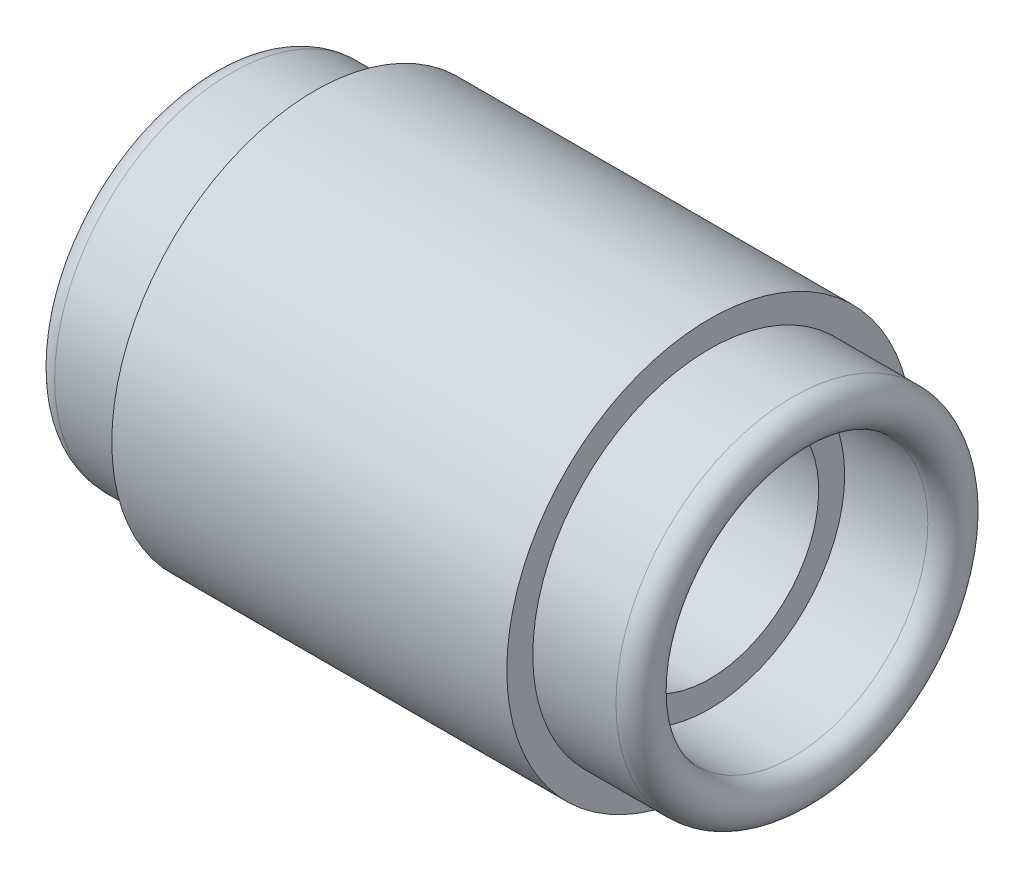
ISO-10303-21;
HEADER;
FILE_DESCRIPTION(('STEP AP214'),'2;1');
FILE_NAME('part.step','',(''),(''),'','','');
FILE_SCHEMA(('AUTOMOTIVE_DESIGN { 1 0 10303 214 1 1 1 1 }'));
ENDSEC;
DATA;
#1=APPLICATION_CONTEXT('core data for automotive mechanical design processes');
#2=APPLICATION_PROTOCOL_DEFINITION('international standard','automotive_design',2000,#1);
#3=PRODUCT_CONTEXT('',#1,'mechanical');
#4=PRODUCT('Part','Part','',(#3));
#5=PRODUCT_RELATED_PRODUCT_CATEGORY('part','',(#4));
#6=PRODUCT_DEFINITION_FORMATION('','',#4);
#7=PRODUCT_DEFINITION_CONTEXT('part definition',#1,'design');
#8=PRODUCT_DEFINITION('design','',#6,#7);
#9=PRODUCT_DEFINITION_SHAPE('','',#8);
#10=(LENGTH_UNIT() NAMED_UNIT(*) SI_UNIT(.MILLI.,.METRE.));
#11=(NAMED_UNIT(*) PLANE_ANGLE_UNIT() SI_UNIT($,.RADIAN.));
#12=(NAMED_UNIT(*) SI_UNIT($,.STERADIAN.) SOLID_ANGLE_UNIT());
#13=UNCERTAINTY_MEASURE_WITH_UNIT(LENGTH_MEASURE(1.E-05),#10,'distance_accuracy_value','');
#14=(GEOMETRIC_REPRESENTATION_CONTEXT(3) GLOBAL_UNCERTAINTY_ASSIGNED_CONTEXT((#13)) GLOBAL_UNIT_ASSIGNED_CONTEXT((#10,
#11,#12)) REPRESENTATION_CONTEXT('',''));
#15=CARTESIAN_POINT('',(0.,0.,0.));
#16=DIRECTION('',(0.,0.,1.));
#17=DIRECTION('',(1.,0.,0.));
#18=AXIS2_PLACEMENT_3D('',#15,#16,#17);
#19=CARTESIAN_POINT('',(16.,39.,0.));
#20=DIRECTION('',(1.,0.,0.));
#21=DIRECTION('',(0.,0.,-1.));
#22=AXIS2_PLACEMENT_3D('',#19,#20,#21);
#23=PLANE('',#22);
#24=CARTESIAN_POINT('',(16.,0.,0.));
#25=DIRECTION('',(-1.,0.,0.));
#26=DIRECTION('',(0.,0.,1.));
#27=AXIS2_PLACEMENT_3D('',#24,#25,#26);
#28=CIRCLE('',#27,34.);
#29=CARTESIAN_POINT('',(16.,0.,34.));
#30=VERTEX_POINT('',#29);
#31=EDGE_CURVE('E10',#30,#30,#28,.T.);
#32=ORIENTED_EDGE('',*,*,#31,.F.);
#33=EDGE_LOOP('',(#32));
#34=FACE_BOUND('',#33,.T.);
#35=CARTESIAN_POINT('',(16.,0.,0.));
#36=DIRECTION('',(-1.,0.,0.));
#37=DIRECTION('',(0.,0.,1.));
#38=AXIS2_PLACEMENT_3D('',#35,#36,#37);
#39=CIRCLE('',#38,39.);
#40=CARTESIAN_POINT('',(16.,0.,39.));
#41=VERTEX_POINT('',#40);
#42=EDGE_CURVE('E74',#41,#41,#39,.T.);
#43=ORIENTED_EDGE('',*,*,#42,.T.);
#44=EDGE_LOOP('',(#43));
#45=FACE_BOUND('',#44,.T.);
#46=ADVANCED_FACE('F34',(#34,#45),#23,.F.);
#47=CARTESIAN_POINT('',(0.,0.,0.));
#48=DIRECTION('',(-1.,0.,0.));
#49=DIRECTION('',(0.,0.,1.));
#50=AXIS2_PLACEMENT_3D('',#47,#48,#49);
#51=CYLINDRICAL_SURFACE('',#50,34.);
#52=CARTESIAN_POINT('',(0.,0.,0.));
#53=DIRECTION('',(-1.,0.,0.));
#54=DIRECTION('',(0.,0.,1.));
#55=AXIS2_PLACEMENT_3D('',#52,#53,#54);
#56=CIRCLE('',#55,34.);
#57=CARTESIAN_POINT('',(0.,0.,34.));
#58=VERTEX_POINT('',#57);
#59=EDGE_CURVE('E40',#58,#58,#56,.T.);
#60=ORIENTED_EDGE('',*,*,#59,.F.);
#61=EDGE_LOOP('',(#60));
#62=FACE_BOUND('',#61,.T.);
#63=ORIENTED_EDGE('',*,*,#31,.T.);
#64=EDGE_LOOP('',(#63));
#65=FACE_BOUND('',#64,.T.);
#66=ADVANCED_FACE('F135',(#62,#65),#51,.T.);
#67=CARTESIAN_POINT('',(0.,0.,0.));
#68=DIRECTION('',(-1.,0.,0.));
#69=DIRECTION('',(0.,0.,1.));
#70=AXIS2_PLACEMENT_3D('',#67,#68,#69);
#71=TOROIDAL_SURFACE('',#70,30.,4.);
#72=CARTESIAN_POINT('',(0.,0.,0.));
#73=DIRECTION('',(-1.,0.,0.));
#74=DIRECTION('',(0.,0.,1.));
#75=AXIS2_PLACEMENT_3D('',#72,#73,#74);
#76=CIRCLE('',#75,26.);
#77=CARTESIAN_POINT('',(0.,0.,26.));
#78=VERTEX_POINT('',#77);
#79=EDGE_CURVE('E44',#78,#78,#76,.T.);
#80=ORIENTED_EDGE('',*,*,#79,.F.);
#81=EDGE_LOOP('',(#80));
#82=FACE_BOUND('',#81,.T.);
#83=ORIENTED_EDGE('',*,*,#59,.T.);
#84=EDGE_LOOP('',(#83));
#85=FACE_BOUND('',#84,.T.);
#86=ADVANCED_FACE('F130',(#82,#85),#71,.T.);
#87=CARTESIAN_POINT('',(0.,0.,0.));
#88=DIRECTION('',(-1.,0.,0.));
#89=DIRECTION('',(0.,0.,1.));
#90=AXIS2_PLACEMENT_3D('',#87,#88,#89);
#91=CYLINDRICAL_SURFACE('',#90,26.);
#92=CARTESIAN_POINT('',(16.,0.,0.));
#93=DIRECTION('',(-1.,0.,0.));
#94=DIRECTION('',(0.,0.,1.));
#95=AXIS2_PLACEMENT_3D('',#92,#93,#94);
#96=CIRCLE('',#95,26.);
#97=CARTESIAN_POINT('',(16.,0.,26.));
#98=VERTEX_POINT('',#97);
#99=EDGE_CURVE('E48',#98,#98,#96,.T.);
#100=ORIENTED_EDGE('',*,*,#99,.F.);
#101=EDGE_LOOP('',(#100));
#102=FACE_BOUND('',#101,.T.);
#103=ORIENTED_EDGE('',*,*,#79,.T.);
#104=EDGE_LOOP('',(#103));
#105=FACE_BOUND('',#104,.T.);
#106=ADVANCED_FACE('F124',(#102,#105),#91,.F.);
#107=CARTESIAN_POINT('',(16.,26.,0.));
#108=DIRECTION('',(1.,0.,0.));
#109=DIRECTION('',(0.,0.,-1.));
#110=AXIS2_PLACEMENT_3D('',#107,#108,#109);
#111=PLANE('',#110);
#112=CARTESIAN_POINT('',(16.,0.,0.));
#113=DIRECTION('',(-1.,0.,0.));
#114=DIRECTION('',(0.,0.,1.));
#115=AXIS2_PLACEMENT_3D('',#112,#113,#114);
#116=CIRCLE('',#115,21.);
#117=CARTESIAN_POINT('',(16.,0.,21.));
#118=VERTEX_POINT('',#117);
#119=EDGE_CURVE('E53',#118,#118,#116,.T.);
#120=ORIENTED_EDGE('',*,*,#119,.F.);
#121=EDGE_LOOP('',(#120));
#122=FACE_BOUND('',#121,.T.);
#123=ORIENTED_EDGE('',*,*,#99,.T.);
#124=EDGE_LOOP('',(#123));
#125=FACE_BOUND('',#124,.T.);
#126=ADVANCED_FACE('F118',(#122,#125),#111,.F.);
#127=CARTESIAN_POINT('',(0.,0.,0.));
#128=DIRECTION('',(-1.,0.,0.));
#129=DIRECTION('',(0.,0.,1.));
#130=AXIS2_PLACEMENT_3D('',#127,#128,#129);
#131=CYLINDRICAL_SURFACE('',#130,21.);
#132=CARTESIAN_POINT('',(92.,0.,0.));
#133=DIRECTION('',(-1.,0.,0.));
#134=DIRECTION('',(0.,0.,1.));
#135=AXIS2_PLACEMENT_3D('',#132,#133,#134);
#136=CIRCLE('',#135,21.);
#137=CARTESIAN_POINT('',(92.,0.,21.));
#138=VERTEX_POINT('',#137);
#139=EDGE_CURVE('E56',#138,#138,#136,.T.);
#140=ORIENTED_EDGE('',*,*,#139,.F.);
#141=EDGE_LOOP('',(#140));
#142=FACE_BOUND('',#141,.T.);
#143=ORIENTED_EDGE('',*,*,#119,.T.);
#144=EDGE_LOOP('',(#143));
#145=FACE_BOUND('',#144,.T.);
#146=ADVANCED_FACE('F112',(#142,#145),#131,.F.);
#147=CARTESIAN_POINT('',(92.,26.,0.));
#148=DIRECTION('',(-1.,0.,0.));
#149=DIRECTION('',(0.,0.,1.));
#150=AXIS2_PLACEMENT_3D('',#147,#148,#149);
#151=PLANE('',#150);
#152=CARTESIAN_POINT('',(92.,0.,0.));
#153=DIRECTION('',(-1.,0.,0.));
#154=DIRECTION('',(0.,0.,1.));
#155=AXIS2_PLACEMENT_3D('',#152,#153,#154);
#156=CIRCLE('',#155,26.);
#157=CARTESIAN_POINT('',(92.,0.,26.));
#158=VERTEX_POINT('',#157);
#159=EDGE_CURVE('E59',#158,#158,#156,.T.);
#160=ORIENTED_EDGE('',*,*,#159,.F.);
#161=EDGE_LOOP('',(#160));
#162=FACE_BOUND('',#161,.T.);
#163=ORIENTED_EDGE('',*,*,#139,.T.);
#164=EDGE_LOOP('',(#163));
#165=FACE_BOUND('',#164,.T.);
#166=ADVANCED_FACE('F106',(#162,#165),#151,.F.);
#167=CARTESIAN_POINT('',(0.,0.,0.));
#168=DIRECTION('',(-1.,0.,0.));
#169=DIRECTION('',(0.,0.,1.));
#170=AXIS2_PLACEMENT_3D('',#167,#168,#169);
#171=CYLINDRICAL_SURFACE('',#170,26.);
#172=CARTESIAN_POINT('',(108.,0.,0.));
#173=DIRECTION('',(-1.,0.,0.));
#174=DIRECTION('',(0.,0.,1.));
#175=AXIS2_PLACEMENT_3D('',#172,#173,#174);
#176=CIRCLE('',#175,26.);
#177=CARTESIAN_POINT('',(108.,0.,26.));
#178=VERTEX_POINT('',#177);
#179=EDGE_CURVE('E62',#178,#178,#176,.T.);
#180=ORIENTED_EDGE('',*,*,#179,.F.);
#181=EDGE_LOOP('',(#180));
#182=FACE_BOUND('',#181,.T.);
#183=ORIENTED_EDGE('',*,*,#159,.T.);
#184=EDGE_LOOP('',(#183));
#185=FACE_BOUND('',#184,.T.);
#186=ADVANCED_FACE('F100',(#182,#185),#171,.F.);
#187=CARTESIAN_POINT('',(108.,0.,0.));
#188=DIRECTION('',(-1.,0.,0.));
#189=DIRECTION('',(0.,0.,1.));
#190=AXIS2_PLACEMENT_3D('',#187,#188,#189);
#191=TOROIDAL_SURFACE('',#190,30.,4.);
#192=CARTESIAN_POINT('',(108.,0.,0.));
#193=DIRECTION('',(-1.,0.,0.));
#194=DIRECTION('',(0.,0.,1.));
#195=AXIS2_PLACEMENT_3D('',#192,#193,#194);
#196=CIRCLE('',#195,34.);
#197=CARTESIAN_POINT('',(108.,0.,34.));
#198=VERTEX_POINT('',#197);
#199=EDGE_CURVE('E65',#198,#198,#196,.T.);
#200=ORIENTED_EDGE('',*,*,#199,.F.);
#201=EDGE_LOOP('',(#200));
#202=FACE_BOUND('',#201,.T.);
#203=ORIENTED_EDGE('',*,*,#179,.T.);
#204=EDGE_LOOP('',(#203));
#205=FACE_BOUND('',#204,.T.);
#206=ADVANCED_FACE('F94',(#202,#205),#191,.T.);
#207=CARTESIAN_POINT('',(0.,0.,0.));
#208=DIRECTION('',(-1.,0.,0.));
#209=DIRECTION('',(0.,0.,1.));
#210=AXIS2_PLACEMENT_3D('',#207,#208,#209);
#211=CYLINDRICAL_SURFACE('',#210,34.);
#212=CARTESIAN_POINT('',(92.,0.,0.));
#213=DIRECTION('',(-1.,0.,0.));
#214=DIRECTION('',(0.,0.,1.));
#215=AXIS2_PLACEMENT_3D('',#212,#213,#214);
#216=CIRCLE('',#215,34.);
#217=CARTESIAN_POINT('',(92.,0.,34.));
#218=VERTEX_POINT('',#217);
#219=EDGE_CURVE('E68',#218,#218,#216,.T.);
#220=ORIENTED_EDGE('',*,*,#219,.F.);
#221=EDGE_LOOP('',(#220));
#222=FACE_BOUND('',#221,.T.);
#223=ORIENTED_EDGE('',*,*,#199,.T.);
#224=EDGE_LOOP('',(#223));
#225=FACE_BOUND('',#224,.T.);
#226=ADVANCED_FACE('F88',(#222,#225),#211,.T.);
#227=CARTESIAN_POINT('',(92.,39.,0.));
#228=DIRECTION('',(-1.,0.,0.));
#229=DIRECTION('',(0.,0.,1.));
#230=AXIS2_PLACEMENT_3D('',#227,#228,#229);
#231=PLANE('',#230);
#232=CARTESIAN_POINT('',(92.,0.,0.));
#233=DIRECTION('',(-1.,0.,0.));
#234=DIRECTION('',(0.,0.,1.));
#235=AXIS2_PLACEMENT_3D('',#232,#233,#234);
#236=CIRCLE('',#235,39.);
#237=CARTESIAN_POINT('',(92.,0.,39.));
#238=VERTEX_POINT('',#237);
#239=EDGE_CURVE('E71',#238,#238,#236,.T.);
#240=ORIENTED_EDGE('',*,*,#239,.F.);
#241=EDGE_LOOP('',(#240));
#242=FACE_BOUND('',#241,.T.);
#243=ORIENTED_EDGE('',*,*,#219,.T.);
#244=EDGE_LOOP('',(#243));
#245=FACE_BOUND('',#244,.T.);
#246=ADVANCED_FACE('F82',(#242,#245),#231,.F.);
#247=CARTESIAN_POINT('',(0.,0.,0.));
#248=DIRECTION('',(-1.,0.,0.));
#249=DIRECTION('',(0.,0.,1.));
#250=AXIS2_PLACEMENT_3D('',#247,#248,#249);
#251=CYLINDRICAL_SURFACE('',#250,39.);
#252=ORIENTED_EDGE('',*,*,#42,.F.);
#253=EDGE_LOOP('',(#252));
#254=FACE_BOUND('',#253,.T.);
#255=ORIENTED_EDGE('',*,*,#239,.T.);
#256=EDGE_LOOP('',(#255));
#257=FACE_BOUND('',#256,.T.);
#258=ADVANCED_FACE('F79',(#254,#257),#251,.T.);
#259=CLOSED_SHELL('',(#46,#66,#86,#106,#126,#146,#166,#186,#206,#226,#246,#258));
#260=MANIFOLD_SOLID_BREP('B2',#259);
#261=ADVANCED_BREP_SHAPE_REPRESENTATION('',(#18,#260),#14);
#262=SHAPE_DEFINITION_REPRESENTATION(#9,#261);
ENDSEC;
END-ISO-10303-21;
